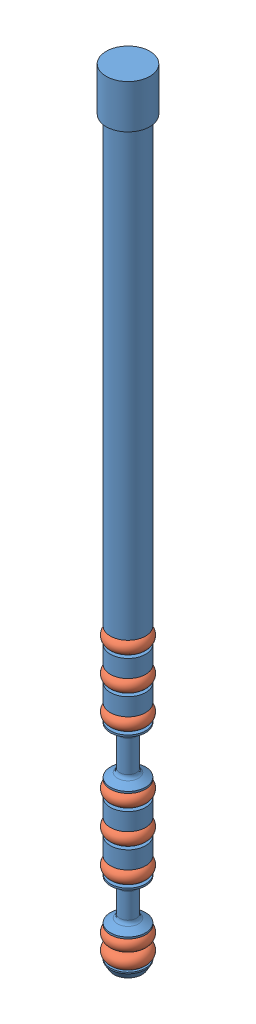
SolidWorks assembly 020600_AR_valve.SLDASM, configuration Default (file format 15000). Lengths in mm.
Overall size (236.56 99.6 14.01).
10 component instances, 2 part files, 6 mates.
Components (placement in the parent):
- 020601_AR_valve-1: 020601_AR_valve.SLDPRT [1.76] at origin size (236.56 99.6 14.01)
- 019903_o-ring-003-5: 019903_o-ring-003.SLDPRT [Default] at (56 -89.5 1.65) x (0.997225 0 -0.074448) z (0.074448 0 0.997225) (suppressed, hidden)
- 019903_o-ring-003-6: 019903_o-ring-003.SLDPRT [Default] at (56 -81.9 1.65) x (0.997225 0 -0.074448) z (0.074448 0 0.997225)
- 019903_o-ring-003-7: 019903_o-ring-003.SLDPRT [Default] at (56 -78.1 1.65) x (0.997225 0 -0.074448) z (0.074448 0 0.997225)
- 019903_o-ring-003-9: 019903_o-ring-003.SLDPRT [Default] at (56 -66.7 1.65) x (0.997225 0 -0.074448) z (0.074448 0 0.997225)
- 019903_o-ring-003-10: 019903_o-ring-003.SLDPRT [Default] at (56 -62.9 1.65) x (0.997225 0 -0.074448) z (0.074448 0 0.997225)
- 019903_o-ring-003-11: 019903_o-ring-003.SLDPRT [Default] at (56 -74.3 1.65) x (0.997225 0 -0.074448) z (0.074448 0 0.997225)
- 019903_o-ring-003-12: 019903_o-ring-003.SLDPRT [Default] at (56 -88.612 1.65) x (0.997225 0 -0.074448) z (0.074448 0 0.997225)
- 019903_o-ring-003-13: 019903_o-ring-003.SLDPRT [Default] at (56 -90.388 1.65)
- 019903_o-ring-003-14: 019903_o-ring-003.SLDPRT [Default] at (56 -59.1 1.65) x (0.997225 0 -0.074448) z (0.074448 0 0.997225)
Mates (geometry in assembly coordinates):
- Concentric2: concentric aligned: cylinder of 020601_AR_valve-1 through (56 -1065.4575 1.65) axis (0 -1 0) radius 0.88; line of 019903_o-ring-003-5 through (56 -34.5 1.65) axis (0 -1 0)
- Symmetric2: symmetric aligned: plane of 020601_AR_valve-1 through (56.88 -91.15 1.65) normal (0 1 0); plane of 019903_o-ring-003-5 through (58.02 -87.85 1.65) normal (0 -1 0); plane of 020601_AR_valve-1 through (56 -89.5 1.65) normal (0 1 0)
- Coincident1: coincident aligned: line of 019903_o-ring-003-9 through (56 -11.7 1.65) axis (0 -1 0); line of 019903_o-ring-003-12 through (56 -33.612 1.65) axis (0 -1 0)
- Tangent2: tangent anti-aligned: plane of 020601_AR_valve-1 through (58.02 -87.85 1.65) normal (0 -1 0); torus of 019903_o-ring-003-12
- Coincident2: coincident aligned: line of 019903_o-ring-003-9 through (56 -11.7 1.65) axis (0 -1 0); line of 019903_o-ring-003-13 through (56 -35.388 1.65) axis (0 -1 0)
- Tangent3: tangent anti-aligned: plane of 020601_AR_valve-1 through (56.88 -91.15 1.65) normal (0 1 0); torus of 019903_o-ring-003-13
